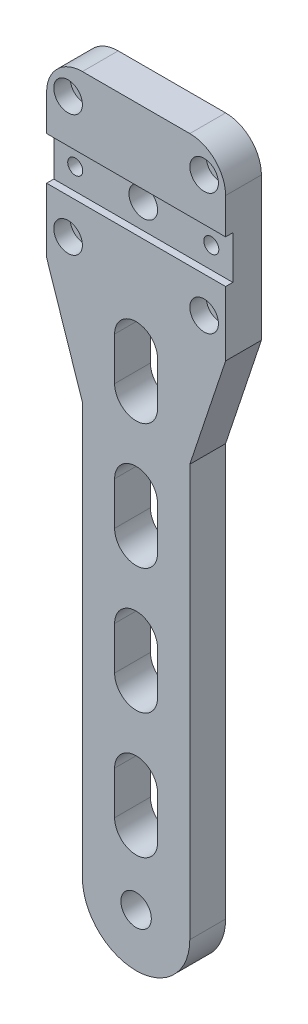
ISO-10303-21;
HEADER;
FILE_DESCRIPTION(('STEP AP214'),'2;1');
FILE_NAME('part.step','',(''),(''),'','','');
FILE_SCHEMA(('AUTOMOTIVE_DESIGN { 1 0 10303 214 1 1 1 1 }'));
ENDSEC;
DATA;
#1=APPLICATION_CONTEXT('core data for automotive mechanical design processes');
#2=APPLICATION_PROTOCOL_DEFINITION('international standard','automotive_design',2000,#1);
#3=PRODUCT_CONTEXT('',#1,'mechanical');
#4=PRODUCT('Part','Part','',(#3));
#5=PRODUCT_RELATED_PRODUCT_CATEGORY('part','',(#4));
#6=PRODUCT_DEFINITION_FORMATION('','',#4);
#7=PRODUCT_DEFINITION_CONTEXT('part definition',#1,'design');
#8=PRODUCT_DEFINITION('design','',#6,#7);
#9=PRODUCT_DEFINITION_SHAPE('','',#8);
#10=(LENGTH_UNIT() NAMED_UNIT(*) SI_UNIT(.MILLI.,.METRE.));
#11=(NAMED_UNIT(*) PLANE_ANGLE_UNIT() SI_UNIT($,.RADIAN.));
#12=(NAMED_UNIT(*) SI_UNIT($,.STERADIAN.) SOLID_ANGLE_UNIT());
#13=UNCERTAINTY_MEASURE_WITH_UNIT(LENGTH_MEASURE(1.E-05),#10,'distance_accuracy_value','');
#14=(GEOMETRIC_REPRESENTATION_CONTEXT(3) GLOBAL_UNCERTAINTY_ASSIGNED_CONTEXT((#13)) GLOBAL_UNIT_ASSIGNED_CONTEXT((#10,
#11,#12)) REPRESENTATION_CONTEXT('',''));
#15=CARTESIAN_POINT('',(0.,0.,0.));
#16=DIRECTION('',(0.,0.,1.));
#17=DIRECTION('',(1.,0.,0.));
#18=AXIS2_PLACEMENT_3D('',#15,#16,#17);
#19=CARTESIAN_POINT('',(0.,0.,10.));
#20=DIRECTION('',(0.,0.,1.));
#21=DIRECTION('',(1.,0.,0.));
#22=AXIS2_PLACEMENT_3D('',#19,#20,#21);
#23=PLANE('',#22);
#24=DIRECTION('',(-1.,0.,0.));
#25=VECTOR('',#24,1.);
#26=CARTESIAN_POINT('',(-333.652444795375,91.7263282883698,10.));
#27=LINE('',#26,#25);
#28=CARTESIAN_POINT('',(-333.652469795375,91.7263282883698,10.));
#29=VERTEX_POINT('',#28);
#30=CARTESIAN_POINT('',(-383.652469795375,91.7263282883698,10.));
#31=VERTEX_POINT('',#30);
#32=EDGE_CURVE('E249',#29,#31,#27,.T.);
#33=ORIENTED_EDGE('',*,*,#32,.T.);
#34=DIRECTION('',(0.,-1.,0.));
#35=VECTOR('',#34,1.);
#36=CARTESIAN_POINT('',(-383.652469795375,123.72632828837,10.));
#37=LINE('',#36,#35);
#38=CARTESIAN_POINT('',(-383.652469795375,73.7263282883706,10.));
#39=VERTEX_POINT('',#38);
#40=EDGE_CURVE('E390',#31,#39,#37,.T.);
#41=ORIENTED_EDGE('',*,*,#40,.T.);
#42=DIRECTION('',(-0.316227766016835,0.948683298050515,0.));
#43=VECTOR('',#42,1.);
#44=CARTESIAN_POINT('',(-323.169324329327,-107.723108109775,10.));
#45=LINE('',#44,#43);
#46=CARTESIAN_POINT('',(-373.652469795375,43.7263282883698,10.));
#47=VERTEX_POINT('',#46);
#48=EDGE_CURVE('E406',#39,#47,#45,.F.);
#49=ORIENTED_EDGE('',*,*,#48,.T.);
#50=DIRECTION('',(0.,-1.,0.));
#51=VECTOR('',#50,1.);
#52=CARTESIAN_POINT('',(-373.652469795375,-86.2736717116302,10.));
#53=LINE('',#52,#51);
#54=CARTESIAN_POINT('',(-373.652469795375,-71.2736717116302,10.));
#55=VERTEX_POINT('',#54);
#56=EDGE_CURVE('E400',#47,#55,#53,.T.);
#57=ORIENTED_EDGE('',*,*,#56,.T.);
#58=CARTESIAN_POINT('',(-358.652469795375,-71.2736717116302,10.));
#59=DIRECTION('',(0.,0.,1.));
#60=DIRECTION('',(1.,0.,0.));
#61=AXIS2_PLACEMENT_3D('',#58,#59,#60);
#62=CIRCLE('',#61,15.);
#63=CARTESIAN_POINT('',(-358.652469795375,-86.2736717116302,10.));
#64=VERTEX_POINT('',#63);
#65=EDGE_CURVE('E526',#55,#64,#62,.T.);
#66=ORIENTED_EDGE('',*,*,#65,.T.);
#67=CARTESIAN_POINT('',(-358.652469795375,-71.2736717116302,10.));
#68=DIRECTION('',(0.,0.,1.));
#69=DIRECTION('',(1.,0.,0.));
#70=AXIS2_PLACEMENT_3D('',#67,#68,#69);
#71=CIRCLE('',#70,15.);
#72=CARTESIAN_POINT('',(-343.652469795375,-71.2736717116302,10.));
#73=VERTEX_POINT('',#72);
#74=EDGE_CURVE('E535',#64,#73,#71,.T.);
#75=ORIENTED_EDGE('',*,*,#74,.T.);
#76=DIRECTION('',(0.,1.,0.));
#77=VECTOR('',#76,1.);
#78=CARTESIAN_POINT('',(-343.652469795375,-86.2736717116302,10.));
#79=LINE('',#78,#77);
#80=CARTESIAN_POINT('',(-343.652469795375,43.7263282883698,10.));
#81=VERTEX_POINT('',#80);
#82=EDGE_CURVE('E460',#73,#81,#79,.T.);
#83=ORIENTED_EDGE('',*,*,#82,.T.);
#84=DIRECTION('',(-0.316227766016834,-0.948683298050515,0.));
#85=VECTOR('',#84,1.);
#86=CARTESIAN_POINT('',(-322.405121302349,107.468373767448,10.));
#87=LINE('',#86,#85);
#88=CARTESIAN_POINT('',(-333.652469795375,73.7263282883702,10.));
#89=VERTEX_POINT('',#88);
#90=EDGE_CURVE('E413',#81,#89,#87,.F.);
#91=ORIENTED_EDGE('',*,*,#90,.T.);
#92=DIRECTION('',(0.,1.,0.));
#93=VECTOR('',#92,1.);
#94=CARTESIAN_POINT('',(-333.652469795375,123.72632828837,10.));
#95=LINE('',#94,#93);
#96=EDGE_CURVE('E490',#89,#29,#95,.T.);
#97=ORIENTED_EDGE('',*,*,#96,.T.);
#98=EDGE_LOOP('',(#33,#41,#49,#57,#66,#75,#83,#91,#97));
#99=FACE_BOUND('',#98,.T.);
#100=CARTESIAN_POINT('',(-377.652469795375,81.7263282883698,10.));
#101=DIRECTION('',(0.,0.,1.));
#102=DIRECTION('',(1.,0.,0.));
#103=AXIS2_PLACEMENT_3D('',#100,#101,#102);
#104=CIRCLE('',#103,4.);
#105=CARTESIAN_POINT('',(-373.652469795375,81.7263282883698,10.));
#106=VERTEX_POINT('',#105);
#107=EDGE_CURVE('E365',#106,#106,#104,.T.);
#108=ORIENTED_EDGE('',*,*,#107,.F.);
#109=EDGE_LOOP('',(#108));
#110=FACE_BOUND('',#109,.T.);
#111=CARTESIAN_POINT('',(-339.652469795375,81.7263282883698,10.));
#112=DIRECTION('',(0.,0.,1.));
#113=DIRECTION('',(1.,0.,0.));
#114=AXIS2_PLACEMENT_3D('',#111,#112,#113);
#115=CIRCLE('',#114,4.);
#116=CARTESIAN_POINT('',(-335.652469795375,81.7263282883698,10.));
#117=VERTEX_POINT('',#116);
#118=EDGE_CURVE('E355',#117,#117,#115,.T.);
#119=ORIENTED_EDGE('',*,*,#118,.F.);
#120=EDGE_LOOP('',(#119));
#121=FACE_BOUND('',#120,.T.);
#122=CARTESIAN_POINT('',(-358.652469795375,-71.5736717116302,10.));
#123=DIRECTION('',(0.,0.,1.));
#124=DIRECTION('',(1.,0.,0.));
#125=AXIS2_PLACEMENT_3D('',#122,#123,#124);
#126=CIRCLE('',#125,4.25);
#127=CARTESIAN_POINT('',(-354.402469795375,-71.5736717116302,10.));
#128=VERTEX_POINT('',#127);
#129=EDGE_CURVE('E341',#128,#128,#126,.T.);
#130=ORIENTED_EDGE('',*,*,#129,.F.);
#131=EDGE_LOOP('',(#130));
#132=FACE_BOUND('',#131,.T.);
#133=CARTESIAN_POINT('',(-358.652469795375,-52.2736717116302,10.));
#134=DIRECTION('',(0.,0.,1.));
#135=DIRECTION('',(1.,0.,0.));
#136=AXIS2_PLACEMENT_3D('',#133,#134,#135);
#137=CIRCLE('',#136,6.);
#138=CARTESIAN_POINT('',(-364.652469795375,-52.2736717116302,10.));
#139=VERTEX_POINT('',#138);
#140=CARTESIAN_POINT('',(-352.652469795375,-52.2736717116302,10.));
#141=VERTEX_POINT('',#140);
#142=EDGE_CURVE('E314',#139,#141,#137,.T.);
#143=ORIENTED_EDGE('',*,*,#142,.F.);
#144=DIRECTION('',(0.,-1.,0.));
#145=VECTOR('',#144,1.);
#146=CARTESIAN_POINT('',(-364.652469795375,-52.2736717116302,10.));
#147=LINE('',#146,#145);
#148=CARTESIAN_POINT('',(-364.652469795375,-40.2736717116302,10.));
#149=VERTEX_POINT('',#148);
#150=EDGE_CURVE('E328',#149,#139,#147,.T.);
#151=ORIENTED_EDGE('',*,*,#150,.F.);
#152=CARTESIAN_POINT('',(-358.652469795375,-40.2736717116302,10.));
#153=DIRECTION('',(0.,0.,1.));
#154=DIRECTION('',(1.,0.,0.));
#155=AXIS2_PLACEMENT_3D('',#152,#153,#154);
#156=CIRCLE('',#155,6.);
#157=CARTESIAN_POINT('',(-352.652469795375,-40.2736717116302,10.));
#158=VERTEX_POINT('',#157);
#159=EDGE_CURVE('E325',#158,#149,#156,.T.);
#160=ORIENTED_EDGE('',*,*,#159,.F.);
#161=DIRECTION('',(0.,1.,0.));
#162=VECTOR('',#161,1.);
#163=CARTESIAN_POINT('',(-352.652469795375,-52.2736717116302,10.));
#164=LINE('',#163,#162);
#165=EDGE_CURVE('E322',#141,#158,#164,.T.);
#166=ORIENTED_EDGE('',*,*,#165,.F.);
#167=EDGE_LOOP('',(#143,#151,#160,#166));
#168=FACE_BOUND('',#167,.T.);
#169=CARTESIAN_POINT('',(-358.652469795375,-17.2736717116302,10.));
#170=DIRECTION('',(0.,0.,1.));
#171=DIRECTION('',(1.,0.,0.));
#172=AXIS2_PLACEMENT_3D('',#169,#170,#171);
#173=CIRCLE('',#172,6.);
#174=CARTESIAN_POINT('',(-364.652469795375,-17.2736717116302,10.));
#175=VERTEX_POINT('',#174);
#176=CARTESIAN_POINT('',(-352.652469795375,-17.2736717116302,10.));
#177=VERTEX_POINT('',#176);
#178=EDGE_CURVE('E294',#175,#177,#173,.T.);
#179=ORIENTED_EDGE('',*,*,#178,.F.);
#180=DIRECTION('',(0.,-1.,0.));
#181=VECTOR('',#180,1.);
#182=CARTESIAN_POINT('',(-364.652469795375,-17.2736717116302,10.));
#183=LINE('',#182,#181);
#184=CARTESIAN_POINT('',(-364.652469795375,-5.27367171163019,10.));
#185=VERTEX_POINT('',#184);
#186=EDGE_CURVE('E308',#185,#175,#183,.T.);
#187=ORIENTED_EDGE('',*,*,#186,.F.);
#188=CARTESIAN_POINT('',(-358.652469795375,-5.27367171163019,10.));
#189=DIRECTION('',(0.,0.,1.));
#190=DIRECTION('',(1.,0.,0.));
#191=AXIS2_PLACEMENT_3D('',#188,#189,#190);
#192=CIRCLE('',#191,6.);
#193=CARTESIAN_POINT('',(-352.652469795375,-5.27367171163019,10.));
#194=VERTEX_POINT('',#193);
#195=EDGE_CURVE('E305',#194,#185,#192,.T.);
#196=ORIENTED_EDGE('',*,*,#195,.F.);
#197=DIRECTION('',(0.,1.,0.));
#198=VECTOR('',#197,1.);
#199=CARTESIAN_POINT('',(-352.652469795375,-17.2736717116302,10.));
#200=LINE('',#199,#198);
#201=EDGE_CURVE('E302',#177,#194,#200,.T.);
#202=ORIENTED_EDGE('',*,*,#201,.F.);
#203=EDGE_LOOP('',(#179,#187,#196,#202));
#204=FACE_BOUND('',#203,.T.);
#205=CARTESIAN_POINT('',(-358.652469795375,17.7263282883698,10.));
#206=DIRECTION('',(0.,0.,1.));
#207=DIRECTION('',(1.,0.,0.));
#208=AXIS2_PLACEMENT_3D('',#205,#206,#207);
#209=CIRCLE('',#208,6.);
#210=CARTESIAN_POINT('',(-364.652469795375,17.7263282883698,10.));
#211=VERTEX_POINT('',#210);
#212=CARTESIAN_POINT('',(-352.652469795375,17.7263282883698,10.));
#213=VERTEX_POINT('',#212);
#214=EDGE_CURVE('E275',#211,#213,#209,.T.);
#215=ORIENTED_EDGE('',*,*,#214,.F.);
#216=DIRECTION('',(0.,-1.,0.));
#217=VECTOR('',#216,1.);
#218=CARTESIAN_POINT('',(-364.652469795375,17.7263282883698,10.));
#219=LINE('',#218,#217);
#220=CARTESIAN_POINT('',(-364.652469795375,29.7263282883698,10.));
#221=VERTEX_POINT('',#220);
#222=EDGE_CURVE('E288',#221,#211,#219,.T.);
#223=ORIENTED_EDGE('',*,*,#222,.F.);
#224=CARTESIAN_POINT('',(-358.652469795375,29.7263282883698,10.));
#225=DIRECTION('',(0.,0.,1.));
#226=DIRECTION('',(1.,0.,0.));
#227=AXIS2_PLACEMENT_3D('',#224,#225,#226);
#228=CIRCLE('',#227,6.);
#229=CARTESIAN_POINT('',(-352.652469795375,29.7263282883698,10.));
#230=VERTEX_POINT('',#229);
#231=EDGE_CURVE('E285',#230,#221,#228,.T.);
#232=ORIENTED_EDGE('',*,*,#231,.F.);
#233=DIRECTION('',(0.,1.,0.));
#234=VECTOR('',#233,1.);
#235=CARTESIAN_POINT('',(-352.652469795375,17.7263282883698,10.));
#236=LINE('',#235,#234);
#237=EDGE_CURVE('E282',#213,#230,#236,.T.);
#238=ORIENTED_EDGE('',*,*,#237,.F.);
#239=EDGE_LOOP('',(#215,#223,#232,#238));
#240=FACE_BOUND('',#239,.T.);
#241=CARTESIAN_POINT('',(-358.652469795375,52.7263282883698,10.));
#242=DIRECTION('',(0.,0.,1.));
#243=DIRECTION('',(1.,0.,0.));
#244=AXIS2_PLACEMENT_3D('',#241,#242,#243);
#245=CIRCLE('',#244,6.);
#246=CARTESIAN_POINT('',(-364.652469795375,52.7263282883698,10.));
#247=VERTEX_POINT('',#246);
#248=CARTESIAN_POINT('',(-352.652469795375,52.7263282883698,10.));
#249=VERTEX_POINT('',#248);
#250=EDGE_CURVE('E41',#247,#249,#245,.T.);
#251=ORIENTED_EDGE('',*,*,#250,.F.);
#252=DIRECTION('',(0.,-1.,0.));
#253=VECTOR('',#252,1.);
#254=CARTESIAN_POINT('',(-364.652469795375,52.7263282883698,10.));
#255=LINE('',#254,#253);
#256=CARTESIAN_POINT('',(-364.652469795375,64.7263282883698,10.));
#257=VERTEX_POINT('',#256);
#258=EDGE_CURVE('E269',#257,#247,#255,.T.);
#259=ORIENTED_EDGE('',*,*,#258,.F.);
#260=CARTESIAN_POINT('',(-358.652469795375,64.7263282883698,10.));
#261=DIRECTION('',(0.,0.,1.));
#262=DIRECTION('',(1.,0.,0.));
#263=AXIS2_PLACEMENT_3D('',#260,#261,#262);
#264=CIRCLE('',#263,6.);
#265=CARTESIAN_POINT('',(-352.652469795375,64.7263282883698,10.));
#266=VERTEX_POINT('',#265);
#267=EDGE_CURVE('E266',#266,#257,#264,.T.);
#268=ORIENTED_EDGE('',*,*,#267,.F.);
#269=DIRECTION('',(0.,1.,0.));
#270=VECTOR('',#269,1.);
#271=CARTESIAN_POINT('',(-352.652469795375,52.7263282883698,10.));
#272=LINE('',#271,#270);
#273=EDGE_CURVE('E263',#249,#266,#272,.T.);
#274=ORIENTED_EDGE('',*,*,#273,.F.);
#275=EDGE_LOOP('',(#251,#259,#268,#274));
#276=FACE_BOUND('',#275,.T.);
#277=ADVANCED_FACE('F16',(#99,#110,#121,#132,#168,#204,#240,#276),#23,.T.);
#278=CARTESIAN_POINT('',(-373.652469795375,-86.2736717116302,10.));
#279=DIRECTION('',(1.,0.,0.));
#280=DIRECTION('',(0.,0.,-1.));
#281=AXIS2_PLACEMENT_3D('',#278,#279,#280);
#282=PLANE('',#281);
#283=DIRECTION('',(0.,-1.,0.));
#284=VECTOR('',#283,1.);
#285=CARTESIAN_POINT('',(-373.652469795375,-86.2736717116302,0.));
#286=LINE('',#285,#284);
#287=CARTESIAN_POINT('',(-373.652469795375,43.7263282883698,0.));
#288=VERTEX_POINT('',#287);
#289=CARTESIAN_POINT('',(-373.652469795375,-71.2736717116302,0.));
#290=VERTEX_POINT('',#289);
#291=EDGE_CURVE('E469',#288,#290,#286,.T.);
#292=ORIENTED_EDGE('',*,*,#291,.T.);
#293=DIRECTION('',(0.,0.,-1.));
#294=VECTOR('',#293,1.);
#295=CARTESIAN_POINT('',(-373.652469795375,-71.2736717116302,10.));
#296=LINE('',#295,#294);
#297=EDGE_CURVE('E532',#290,#55,#296,.F.);
#298=ORIENTED_EDGE('',*,*,#297,.T.);
#299=ORIENTED_EDGE('',*,*,#56,.F.);
#300=DIRECTION('',(0.,0.,1.));
#301=VECTOR('',#300,1.);
#302=CARTESIAN_POINT('',(-373.652469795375,43.7263282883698,0.));
#303=LINE('',#302,#301);
#304=EDGE_CURVE('E387',#288,#47,#303,.T.);
#305=ORIENTED_EDGE('',*,*,#304,.F.);
#306=EDGE_LOOP('',(#292,#298,#299,#305));
#307=FACE_BOUND('',#306,.T.);
#308=ADVANCED_FACE('F610',(#307),#282,.F.);
#309=CARTESIAN_POINT('',(-343.652469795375,-86.2736717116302,10.));
#310=DIRECTION('',(-1.,0.,0.));
#311=DIRECTION('',(0.,0.,1.));
#312=AXIS2_PLACEMENT_3D('',#309,#310,#311);
#313=PLANE('',#312);
#314=ORIENTED_EDGE('',*,*,#82,.F.);
#315=DIRECTION('',(0.,0.,-1.));
#316=VECTOR('',#315,1.);
#317=CARTESIAN_POINT('',(-343.652469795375,-71.2736717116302,10.));
#318=LINE('',#317,#316);
#319=CARTESIAN_POINT('',(-343.652469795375,-71.2736717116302,0.));
#320=VERTEX_POINT('',#319);
#321=EDGE_CURVE('E444',#73,#320,#318,.T.);
#322=ORIENTED_EDGE('',*,*,#321,.T.);
#323=DIRECTION('',(0.,1.,0.));
#324=VECTOR('',#323,1.);
#325=CARTESIAN_POINT('',(-343.652469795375,-86.2736717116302,0.));
#326=LINE('',#325,#324);
#327=CARTESIAN_POINT('',(-343.652469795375,43.7263282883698,0.));
#328=VERTEX_POINT('',#327);
#329=EDGE_CURVE('E455',#320,#328,#326,.T.);
#330=ORIENTED_EDGE('',*,*,#329,.T.);
#331=DIRECTION('',(0.,0.,1.));
#332=VECTOR('',#331,1.);
#333=CARTESIAN_POINT('',(-343.652469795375,43.7263282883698,0.));
#334=LINE('',#333,#332);
#335=EDGE_CURVE('E472',#328,#81,#334,.T.);
#336=ORIENTED_EDGE('',*,*,#335,.T.);
#337=EDGE_LOOP('',(#314,#322,#330,#336));
#338=FACE_BOUND('',#337,.T.);
#339=ADVANCED_FACE('F518',(#338),#313,.F.);
#340=CARTESIAN_POINT('',(-343.652469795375,123.72632828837,10.));
#341=DIRECTION('',(0.,-1.,0.));
#342=DIRECTION('',(0.,0.,-1.));
#343=AXIS2_PLACEMENT_3D('',#340,#341,#342);
#344=PLANE('',#343);
#345=DIRECTION('',(-1.,0.,0.));
#346=VECTOR('',#345,1.);
#347=CARTESIAN_POINT('',(-343.652469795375,123.72632828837,0.));
#348=LINE('',#347,#346);
#349=CARTESIAN_POINT('',(-343.652469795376,123.72632828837,0.));
#350=VERTEX_POINT('',#349);
#351=CARTESIAN_POINT('',(-373.652469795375,123.72632828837,0.));
#352=VERTEX_POINT('',#351);
#353=EDGE_CURVE('E458',#350,#352,#348,.T.);
#354=ORIENTED_EDGE('',*,*,#353,.T.);
#355=DIRECTION('',(0.,0.,1.));
#356=VECTOR('',#355,1.);
#357=CARTESIAN_POINT('',(-373.652469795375,123.72632828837,10.));
#358=LINE('',#357,#356);
#359=CARTESIAN_POINT('',(-373.652469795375,123.72632828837,10.));
#360=VERTEX_POINT('',#359);
#361=EDGE_CURVE('E428',#352,#360,#358,.T.);
#362=ORIENTED_EDGE('',*,*,#361,.T.);
#363=DIRECTION('',(-1.,0.,0.));
#364=VECTOR('',#363,1.);
#365=CARTESIAN_POINT('',(-343.652469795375,123.72632828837,10.));
#366=LINE('',#365,#364);
#367=CARTESIAN_POINT('',(-343.652469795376,123.72632828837,10.));
#368=VERTEX_POINT('',#367);
#369=EDGE_CURVE('E478',#368,#360,#366,.T.);
#370=ORIENTED_EDGE('',*,*,#369,.F.);
#371=DIRECTION('',(0.,0.,1.));
#372=VECTOR('',#371,1.);
#373=CARTESIAN_POINT('',(-343.652469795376,123.72632828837,0.));
#374=LINE('',#373,#372);
#375=EDGE_CURVE('E424',#368,#350,#374,.F.);
#376=ORIENTED_EDGE('',*,*,#375,.T.);
#377=EDGE_LOOP('',(#354,#362,#370,#376));
#378=FACE_BOUND('',#377,.T.);
#379=ADVANCED_FACE('F621',(#378),#344,.F.);
#380=DIRECTION('',(-1.,0.,0.));
#381=VECTOR('',#380,1.);
#382=CARTESIAN_POINT('',(-333.652444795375,103.72632828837,10.));
#383=LINE('',#382,#381);
#384=CARTESIAN_POINT('',(-333.652469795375,103.72632828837,10.));
#385=VERTEX_POINT('',#384);
#386=CARTESIAN_POINT('',(-383.652469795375,103.72632828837,10.));
#387=VERTEX_POINT('',#386);
#388=EDGE_CURVE('E33',#385,#387,#383,.T.);
#389=ORIENTED_EDGE('',*,*,#388,.F.);
#390=CARTESIAN_POINT('',(-333.652469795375,113.72632828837,10.));
#391=VERTEX_POINT('',#390);
#392=EDGE_CURVE('E399',#385,#391,#95,.T.);
#393=ORIENTED_EDGE('',*,*,#392,.T.);
#394=CARTESIAN_POINT('',(-343.652469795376,113.72632828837,10.));
#395=DIRECTION('',(0.,0.,1.));
#396=DIRECTION('',(1.,0.,0.));
#397=AXIS2_PLACEMENT_3D('',#394,#395,#396);
#398=CIRCLE('',#397,10.);
#399=EDGE_CURVE('E431',#391,#368,#398,.T.);
#400=ORIENTED_EDGE('',*,*,#399,.T.);
#401=ORIENTED_EDGE('',*,*,#369,.T.);
#402=CARTESIAN_POINT('',(-373.652469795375,113.72632828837,10.));
#403=DIRECTION('',(0.,0.,1.));
#404=DIRECTION('',(1.,0.,0.));
#405=AXIS2_PLACEMENT_3D('',#402,#403,#404);
#406=CIRCLE('',#405,10.);
#407=CARTESIAN_POINT('',(-383.652469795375,113.72632828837,10.));
#408=VERTEX_POINT('',#407);
#409=EDGE_CURVE('E433',#360,#408,#406,.T.);
#410=ORIENTED_EDGE('',*,*,#409,.T.);
#411=EDGE_CURVE('E388',#408,#387,#37,.T.);
#412=ORIENTED_EDGE('',*,*,#411,.T.);
#413=EDGE_LOOP('',(#389,#393,#400,#401,#410,#412));
#414=FACE_BOUND('',#413,.T.);
#415=CARTESIAN_POINT('',(-339.652469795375,115.72632828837,10.));
#416=DIRECTION('',(0.,0.,1.));
#417=DIRECTION('',(1.,0.,0.));
#418=AXIS2_PLACEMENT_3D('',#415,#416,#417);
#419=CIRCLE('',#418,4.);
#420=CARTESIAN_POINT('',(-335.652469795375,115.72632828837,10.));
#421=VERTEX_POINT('',#420);
#422=EDGE_CURVE('E345',#421,#421,#419,.T.);
#423=ORIENTED_EDGE('',*,*,#422,.F.);
#424=EDGE_LOOP('',(#423));
#425=FACE_BOUND('',#424,.T.);
#426=CARTESIAN_POINT('',(-377.652469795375,115.72632828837,10.));
#427=DIRECTION('',(0.,0.,1.));
#428=DIRECTION('',(1.,0.,0.));
#429=AXIS2_PLACEMENT_3D('',#426,#427,#428);
#430=CIRCLE('',#429,4.);
#431=CARTESIAN_POINT('',(-373.652469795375,115.72632828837,10.));
#432=VERTEX_POINT('',#431);
#433=EDGE_CURVE('E375',#432,#432,#430,.T.);
#434=ORIENTED_EDGE('',*,*,#433,.F.);
#435=EDGE_LOOP('',(#434));
#436=FACE_BOUND('',#435,.T.);
#437=ADVANCED_FACE('F496',(#414,#425,#436),#23,.T.);
#438=CARTESIAN_POINT('',(0.,0.,0.));
#439=DIRECTION('',(0.,0.,1.));
#440=DIRECTION('',(1.,0.,0.));
#441=AXIS2_PLACEMENT_3D('',#438,#439,#440);
#442=PLANE('',#441);
#443=CARTESIAN_POINT('',(-339.652469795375,97.7263282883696,0.));
#444=DIRECTION('',(0.,0.,1.));
#445=DIRECTION('',(1.,0.,0.));
#446=AXIS2_PLACEMENT_3D('',#443,#444,#445);
#447=CIRCLE('',#446,2.1);
#448=CARTESIAN_POINT('',(-337.552469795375,97.7263282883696,0.));
#449=VERTEX_POINT('',#448);
#450=EDGE_CURVE('E20',#449,#449,#447,.T.);
#451=ORIENTED_EDGE('',*,*,#450,.T.);
#452=EDGE_LOOP('',(#451));
#453=FACE_BOUND('',#452,.T.);
#454=CARTESIAN_POINT('',(-377.652469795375,97.7263282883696,0.));
#455=DIRECTION('',(0.,0.,1.));
#456=DIRECTION('',(1.,0.,0.));
#457=AXIS2_PLACEMENT_3D('',#454,#455,#456);
#458=CIRCLE('',#457,2.1);
#459=CARTESIAN_POINT('',(-375.552469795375,97.7263282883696,0.));
#460=VERTEX_POINT('',#459);
#461=EDGE_CURVE('E583',#460,#460,#458,.T.);
#462=ORIENTED_EDGE('',*,*,#461,.T.);
#463=EDGE_LOOP('',(#462));
#464=FACE_BOUND('',#463,.T.);
#465=DIRECTION('',(0.,-1.,0.));
#466=VECTOR('',#465,1.);
#467=CARTESIAN_POINT('',(-364.652469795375,0.,0.));
#468=LINE('',#467,#466);
#469=CARTESIAN_POINT('',(-364.652469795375,64.7263282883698,0.));
#470=VERTEX_POINT('',#469);
#471=CARTESIAN_POINT('',(-364.652469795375,52.7263282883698,0.));
#472=VERTEX_POINT('',#471);
#473=EDGE_CURVE('E25',#470,#472,#468,.T.);
#474=ORIENTED_EDGE('',*,*,#473,.T.);
#475=CARTESIAN_POINT('',(-358.652469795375,52.7263282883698,0.));
#476=DIRECTION('',(0.,0.,1.));
#477=DIRECTION('',(1.,0.,0.));
#478=AXIS2_PLACEMENT_3D('',#475,#476,#477);
#479=CIRCLE('',#478,6.);
#480=CARTESIAN_POINT('',(-352.652469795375,52.7263282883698,0.));
#481=VERTEX_POINT('',#480);
#482=EDGE_CURVE('E11',#472,#481,#479,.T.);
#483=ORIENTED_EDGE('',*,*,#482,.T.);
#484=DIRECTION('',(0.,1.,0.));
#485=VECTOR('',#484,1.);
#486=CARTESIAN_POINT('',(-352.652469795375,0.,0.));
#487=LINE('',#486,#485);
#488=CARTESIAN_POINT('',(-352.652469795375,64.7263282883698,0.));
#489=VERTEX_POINT('',#488);
#490=EDGE_CURVE('E576',#481,#489,#487,.T.);
#491=ORIENTED_EDGE('',*,*,#490,.T.);
#492=CARTESIAN_POINT('',(-358.652469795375,64.7263282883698,0.));
#493=DIRECTION('',(0.,0.,1.));
#494=DIRECTION('',(1.,0.,0.));
#495=AXIS2_PLACEMENT_3D('',#492,#493,#494);
#496=CIRCLE('',#495,6.);
#497=EDGE_CURVE('E579',#489,#470,#496,.T.);
#498=ORIENTED_EDGE('',*,*,#497,.T.);
#499=EDGE_LOOP('',(#474,#483,#491,#498));
#500=FACE_BOUND('',#499,.T.);
#501=DIRECTION('',(0.,-1.,0.));
#502=VECTOR('',#501,1.);
#503=CARTESIAN_POINT('',(-364.652469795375,0.,0.));
#504=LINE('',#503,#502);
#505=CARTESIAN_POINT('',(-364.652469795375,29.7263282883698,0.));
#506=VERTEX_POINT('',#505);
#507=CARTESIAN_POINT('',(-364.652469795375,17.7263282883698,0.));
#508=VERTEX_POINT('',#507);
#509=EDGE_CURVE('E570',#506,#508,#504,.T.);
#510=ORIENTED_EDGE('',*,*,#509,.T.);
#511=CARTESIAN_POINT('',(-358.652469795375,17.7263282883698,0.));
#512=DIRECTION('',(0.,0.,1.));
#513=DIRECTION('',(1.,0.,0.));
#514=AXIS2_PLACEMENT_3D('',#511,#512,#513);
#515=CIRCLE('',#514,6.);
#516=CARTESIAN_POINT('',(-352.652469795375,17.7263282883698,0.));
#517=VERTEX_POINT('',#516);
#518=EDGE_CURVE('E573',#508,#517,#515,.T.);
#519=ORIENTED_EDGE('',*,*,#518,.T.);
#520=DIRECTION('',(0.,1.,0.));
#521=VECTOR('',#520,1.);
#522=CARTESIAN_POINT('',(-352.652469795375,0.,0.));
#523=LINE('',#522,#521);
#524=CARTESIAN_POINT('',(-352.652469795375,29.7263282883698,0.));
#525=VERTEX_POINT('',#524);
#526=EDGE_CURVE('E564',#517,#525,#523,.T.);
#527=ORIENTED_EDGE('',*,*,#526,.T.);
#528=CARTESIAN_POINT('',(-358.652469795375,29.7263282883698,0.));
#529=DIRECTION('',(0.,0.,1.));
#530=DIRECTION('',(1.,0.,0.));
#531=AXIS2_PLACEMENT_3D('',#528,#529,#530);
#532=CIRCLE('',#531,6.);
#533=EDGE_CURVE('E567',#525,#506,#532,.T.);
#534=ORIENTED_EDGE('',*,*,#533,.T.);
#535=EDGE_LOOP('',(#510,#519,#527,#534));
#536=FACE_BOUND('',#535,.T.);
#537=DIRECTION('',(0.,-1.,0.));
#538=VECTOR('',#537,1.);
#539=CARTESIAN_POINT('',(-364.652469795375,0.,0.));
#540=LINE('',#539,#538);
#541=CARTESIAN_POINT('',(-364.652469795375,-5.27367171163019,0.));
#542=VERTEX_POINT('',#541);
#543=CARTESIAN_POINT('',(-364.652469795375,-17.2736717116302,0.));
#544=VERTEX_POINT('',#543);
#545=EDGE_CURVE('E558',#542,#544,#540,.T.);
#546=ORIENTED_EDGE('',*,*,#545,.T.);
#547=CARTESIAN_POINT('',(-358.652469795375,-17.2736717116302,0.));
#548=DIRECTION('',(0.,0.,1.));
#549=DIRECTION('',(1.,0.,0.));
#550=AXIS2_PLACEMENT_3D('',#547,#548,#549);
#551=CIRCLE('',#550,6.);
#552=CARTESIAN_POINT('',(-352.652469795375,-17.2736717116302,0.));
#553=VERTEX_POINT('',#552);
#554=EDGE_CURVE('E561',#544,#553,#551,.T.);
#555=ORIENTED_EDGE('',*,*,#554,.T.);
#556=DIRECTION('',(0.,1.,0.));
#557=VECTOR('',#556,1.);
#558=CARTESIAN_POINT('',(-352.652469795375,0.,0.));
#559=LINE('',#558,#557);
#560=CARTESIAN_POINT('',(-352.652469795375,-5.27367171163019,0.));
#561=VERTEX_POINT('',#560);
#562=EDGE_CURVE('E552',#553,#561,#559,.T.);
#563=ORIENTED_EDGE('',*,*,#562,.T.);
#564=CARTESIAN_POINT('',(-358.652469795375,-5.27367171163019,0.));
#565=DIRECTION('',(0.,0.,1.));
#566=DIRECTION('',(1.,0.,0.));
#567=AXIS2_PLACEMENT_3D('',#564,#565,#566);
#568=CIRCLE('',#567,6.);
#569=EDGE_CURVE('E555',#561,#542,#568,.T.);
#570=ORIENTED_EDGE('',*,*,#569,.T.);
#571=EDGE_LOOP('',(#546,#555,#563,#570));
#572=FACE_BOUND('',#571,.T.);
#573=DIRECTION('',(0.,-1.,0.));
#574=VECTOR('',#573,1.);
#575=CARTESIAN_POINT('',(-364.652469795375,0.,0.));
#576=LINE('',#575,#574);
#577=CARTESIAN_POINT('',(-364.652469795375,-40.2736717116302,0.));
#578=VERTEX_POINT('',#577);
#579=CARTESIAN_POINT('',(-364.652469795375,-52.2736717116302,0.));
#580=VERTEX_POINT('',#579);
#581=EDGE_CURVE('E546',#578,#580,#576,.T.);
#582=ORIENTED_EDGE('',*,*,#581,.T.);
#583=CARTESIAN_POINT('',(-358.652469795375,-52.2736717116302,0.));
#584=DIRECTION('',(0.,0.,1.));
#585=DIRECTION('',(1.,0.,0.));
#586=AXIS2_PLACEMENT_3D('',#583,#584,#585);
#587=CIRCLE('',#586,6.);
#588=CARTESIAN_POINT('',(-352.652469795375,-52.2736717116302,0.));
#589=VERTEX_POINT('',#588);
#590=EDGE_CURVE('E549',#580,#589,#587,.T.);
#591=ORIENTED_EDGE('',*,*,#590,.T.);
#592=DIRECTION('',(0.,1.,0.));
#593=VECTOR('',#592,1.);
#594=CARTESIAN_POINT('',(-352.652469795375,0.,0.));
#595=LINE('',#594,#593);
#596=CARTESIAN_POINT('',(-352.652469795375,-40.2736717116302,0.));
#597=VERTEX_POINT('',#596);
#598=EDGE_CURVE('E540',#589,#597,#595,.T.);
#599=ORIENTED_EDGE('',*,*,#598,.T.);
#600=CARTESIAN_POINT('',(-358.652469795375,-40.2736717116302,0.));
#601=DIRECTION('',(0.,0.,1.));
#602=DIRECTION('',(1.,0.,0.));
#603=AXIS2_PLACEMENT_3D('',#600,#601,#602);
#604=CIRCLE('',#603,6.);
#605=EDGE_CURVE('E543',#597,#578,#604,.T.);
#606=ORIENTED_EDGE('',*,*,#605,.T.);
#607=EDGE_LOOP('',(#582,#591,#599,#606));
#608=FACE_BOUND('',#607,.T.);
#609=CARTESIAN_POINT('',(-358.652469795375,-71.5736717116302,0.));
#610=DIRECTION('',(0.,0.,1.));
#611=DIRECTION('',(1.,0.,0.));
#612=AXIS2_PLACEMENT_3D('',#609,#610,#611);
#613=CIRCLE('',#612,4.25);
#614=CARTESIAN_POINT('',(-354.402469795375,-71.5736717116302,0.));
#615=VERTEX_POINT('',#614);
#616=EDGE_CURVE('E344',#615,#615,#613,.T.);
#617=ORIENTED_EDGE('',*,*,#616,.T.);
#618=EDGE_LOOP('',(#617));
#619=FACE_BOUND('',#618,.T.);
#620=CARTESIAN_POINT('',(-339.652469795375,115.72632828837,0.));
#621=DIRECTION('',(0.,0.,1.));
#622=DIRECTION('',(1.,0.,0.));
#623=AXIS2_PLACEMENT_3D('',#620,#621,#622);
#624=CIRCLE('',#623,2.24999999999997);
#625=CARTESIAN_POINT('',(-337.402469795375,115.72632828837,0.));
#626=VERTEX_POINT('',#625);
#627=EDGE_CURVE('E354',#626,#626,#624,.T.);
#628=ORIENTED_EDGE('',*,*,#627,.T.);
#629=EDGE_LOOP('',(#628));
#630=FACE_BOUND('',#629,.T.);
#631=CARTESIAN_POINT('',(-339.652469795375,81.7263282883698,0.));
#632=DIRECTION('',(0.,0.,1.));
#633=DIRECTION('',(1.,0.,0.));
#634=AXIS2_PLACEMENT_3D('',#631,#632,#633);
#635=CIRCLE('',#634,2.24999999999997);
#636=CARTESIAN_POINT('',(-337.402469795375,81.7263282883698,0.));
#637=VERTEX_POINT('',#636);
#638=EDGE_CURVE('E364',#637,#637,#635,.T.);
#639=ORIENTED_EDGE('',*,*,#638,.T.);
#640=EDGE_LOOP('',(#639));
#641=FACE_BOUND('',#640,.T.);
#642=CARTESIAN_POINT('',(-377.652469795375,81.7263282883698,0.));
#643=DIRECTION('',(0.,0.,1.));
#644=DIRECTION('',(1.,0.,0.));
#645=AXIS2_PLACEMENT_3D('',#642,#643,#644);
#646=CIRCLE('',#645,2.24999999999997);
#647=CARTESIAN_POINT('',(-375.402469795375,81.7263282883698,0.));
#648=VERTEX_POINT('',#647);
#649=EDGE_CURVE('E374',#648,#648,#646,.T.);
#650=ORIENTED_EDGE('',*,*,#649,.T.);
#651=EDGE_LOOP('',(#650));
#652=FACE_BOUND('',#651,.T.);
#653=CARTESIAN_POINT('',(-377.652469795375,115.72632828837,0.));
#654=DIRECTION('',(0.,0.,1.));
#655=DIRECTION('',(1.,0.,0.));
#656=AXIS2_PLACEMENT_3D('',#653,#654,#655);
#657=CIRCLE('',#656,2.24999999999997);
#658=CARTESIAN_POINT('',(-375.402469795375,115.72632828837,0.));
#659=VERTEX_POINT('',#658);
#660=EDGE_CURVE('E384',#659,#659,#657,.T.);
#661=ORIENTED_EDGE('',*,*,#660,.T.);
#662=EDGE_LOOP('',(#661));
#663=FACE_BOUND('',#662,.T.);
#664=CARTESIAN_POINT('',(-358.652469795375,98.7263282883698,0.));
#665=DIRECTION('',(0.,0.,1.));
#666=DIRECTION('',(1.,0.,0.));
#667=AXIS2_PLACEMENT_3D('',#664,#665,#666);
#668=CIRCLE('',#667,4.);
#669=CARTESIAN_POINT('',(-354.652469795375,98.7263282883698,0.));
#670=VERTEX_POINT('',#669);
#671=EDGE_CURVE('E459',#670,#670,#668,.T.);
#672=ORIENTED_EDGE('',*,*,#671,.T.);
#673=EDGE_LOOP('',(#672));
#674=FACE_BOUND('',#673,.T.);
#675=ORIENTED_EDGE('',*,*,#329,.F.);
#676=CARTESIAN_POINT('',(-358.652469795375,-71.2736717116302,0.));
#677=DIRECTION('',(0.,0.,1.));
#678=DIRECTION('',(1.,0.,0.));
#679=AXIS2_PLACEMENT_3D('',#676,#677,#678);
#680=CIRCLE('',#679,15.);
#681=CARTESIAN_POINT('',(-358.652469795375,-86.2736717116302,0.));
#682=VERTEX_POINT('',#681);
#683=EDGE_CURVE('E521',#320,#682,#680,.F.);
#684=ORIENTED_EDGE('',*,*,#683,.T.);
#685=CARTESIAN_POINT('',(-358.652469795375,-71.2736717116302,0.));
#686=DIRECTION('',(0.,0.,1.));
#687=DIRECTION('',(1.,0.,0.));
#688=AXIS2_PLACEMENT_3D('',#685,#686,#687);
#689=CIRCLE('',#688,15.);
#690=EDGE_CURVE('E523',#682,#290,#689,.F.);
#691=ORIENTED_EDGE('',*,*,#690,.T.);
#692=ORIENTED_EDGE('',*,*,#291,.F.);
#693=DIRECTION('',(0.316227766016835,-0.948683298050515,0.));
#694=VECTOR('',#693,1.);
#695=CARTESIAN_POINT('',(-383.652469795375,73.7263282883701,0.));
#696=LINE('',#695,#694);
#697=CARTESIAN_POINT('',(-383.652469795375,73.7263282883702,0.));
#698=VERTEX_POINT('',#697);
#699=EDGE_CURVE('E408',#288,#698,#696,.F.);
#700=ORIENTED_EDGE('',*,*,#699,.T.);
#701=DIRECTION('',(0.,-1.,0.));
#702=VECTOR('',#701,1.);
#703=CARTESIAN_POINT('',(-383.652469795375,123.72632828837,0.));
#704=LINE('',#703,#702);
#705=CARTESIAN_POINT('',(-383.652469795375,113.72632828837,0.));
#706=VERTEX_POINT('',#705);
#707=EDGE_CURVE('E385',#706,#698,#704,.T.);
#708=ORIENTED_EDGE('',*,*,#707,.F.);
#709=CARTESIAN_POINT('',(-373.652469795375,113.72632828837,0.));
#710=DIRECTION('',(0.,0.,1.));
#711=DIRECTION('',(1.,0.,0.));
#712=AXIS2_PLACEMENT_3D('',#709,#710,#711);
#713=CIRCLE('',#712,10.);
#714=EDGE_CURVE('E439',#706,#352,#713,.F.);
#715=ORIENTED_EDGE('',*,*,#714,.T.);
#716=ORIENTED_EDGE('',*,*,#353,.F.);
#717=CARTESIAN_POINT('',(-343.652469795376,113.72632828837,0.));
#718=DIRECTION('',(0.,0.,1.));
#719=DIRECTION('',(1.,0.,0.));
#720=AXIS2_PLACEMENT_3D('',#717,#718,#719);
#721=CIRCLE('',#720,10.);
#722=CARTESIAN_POINT('',(-333.652469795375,113.72632828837,0.));
#723=VERTEX_POINT('',#722);
#724=EDGE_CURVE('E437',#350,#723,#721,.F.);
#725=ORIENTED_EDGE('',*,*,#724,.T.);
#726=DIRECTION('',(0.,1.,0.));
#727=VECTOR('',#726,1.);
#728=CARTESIAN_POINT('',(-333.652469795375,123.72632828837,0.));
#729=LINE('',#728,#727);
#730=CARTESIAN_POINT('',(-333.652469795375,73.7263282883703,0.));
#731=VERTEX_POINT('',#730);
#732=EDGE_CURVE('E393',#731,#723,#729,.T.);
#733=ORIENTED_EDGE('',*,*,#732,.F.);
#734=DIRECTION('',(0.316227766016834,0.948683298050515,0.));
#735=VECTOR('',#734,1.);
#736=CARTESIAN_POINT('',(-343.652469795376,43.7263282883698,0.));
#737=LINE('',#736,#735);
#738=EDGE_CURVE('E421',#731,#328,#737,.F.);
#739=ORIENTED_EDGE('',*,*,#738,.T.);
#740=EDGE_LOOP('',(#675,#684,#691,#692,#700,#708,#715,#716,#725,#733,#739));
#741=FACE_BOUND('',#740,.T.);
#742=ADVANCED_FACE('F511',(#453,#464,#500,#536,#572,#608,#619,#630,#641,#652,#663,#674,#741),
#442,.F.);
#743=CARTESIAN_POINT('',(-358.652469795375,98.7263282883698,0.));
#744=DIRECTION('',(0.,0.,1.));
#745=DIRECTION('',(1.,0.,0.));
#746=AXIS2_PLACEMENT_3D('',#743,#744,#745);
#747=CYLINDRICAL_SURFACE('',#746,4.);
#748=CARTESIAN_POINT('',(-358.652469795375,98.7263282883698,8.));
#749=DIRECTION('',(0.,0.,-1.));
#750=DIRECTION('',(-1.,0.,0.));
#751=AXIS2_PLACEMENT_3D('',#748,#749,#750);
#752=CIRCLE('',#751,4.);
#753=CARTESIAN_POINT('',(-362.652469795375,98.7263282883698,8.));
#754=VERTEX_POINT('',#753);
#755=EDGE_CURVE('E257',#754,#754,#752,.F.);
#756=ORIENTED_EDGE('',*,*,#755,.T.);
#757=EDGE_LOOP('',(#756));
#758=FACE_BOUND('',#757,.T.);
#759=ORIENTED_EDGE('',*,*,#671,.F.);
#760=EDGE_LOOP('',(#759));
#761=FACE_BOUND('',#760,.T.);
#762=ADVANCED_FACE('F627',(#758,#761),#747,.F.);
#763=CARTESIAN_POINT('',(-333.652469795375,123.72632828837,0.));
#764=DIRECTION('',(1.,0.,0.));
#765=DIRECTION('',(0.,0.,-1.));
#766=AXIS2_PLACEMENT_3D('',#763,#764,#765);
#767=PLANE('',#766);
#768=DIRECTION('',(0.,0.,-1.));
#769=VECTOR('',#768,1.);
#770=CARTESIAN_POINT('',(-333.652469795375,91.7263282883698,0.));
#771=LINE('',#770,#769);
#772=CARTESIAN_POINT('',(-333.652469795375,91.7263282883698,8.));
#773=VERTEX_POINT('',#772);
#774=EDGE_CURVE('E260',#29,#773,#771,.T.);
#775=ORIENTED_EDGE('',*,*,#774,.F.);
#776=ORIENTED_EDGE('',*,*,#96,.F.);
#777=DIRECTION('',(0.,0.,-1.));
#778=VECTOR('',#777,1.);
#779=CARTESIAN_POINT('',(-333.652469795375,73.7263282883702,0.));
#780=LINE('',#779,#778);
#781=EDGE_CURVE('E417',#89,#731,#780,.T.);
#782=ORIENTED_EDGE('',*,*,#781,.T.);
#783=ORIENTED_EDGE('',*,*,#732,.T.);
#784=DIRECTION('',(0.,0.,1.));
#785=VECTOR('',#784,1.);
#786=CARTESIAN_POINT('',(-333.652469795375,113.72632828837,10.));
#787=LINE('',#786,#785);
#788=EDGE_CURVE('E441',#723,#391,#787,.T.);
#789=ORIENTED_EDGE('',*,*,#788,.T.);
#790=ORIENTED_EDGE('',*,*,#392,.F.);
#791=DIRECTION('',(0.,0.,1.));
#792=VECTOR('',#791,1.);
#793=CARTESIAN_POINT('',(-333.652469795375,103.72632828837,0.));
#794=LINE('',#793,#792);
#795=CARTESIAN_POINT('',(-333.652469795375,103.72632828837,8.));
#796=VERTEX_POINT('',#795);
#797=EDGE_CURVE('E252',#796,#385,#794,.T.);
#798=ORIENTED_EDGE('',*,*,#797,.F.);
#799=DIRECTION('',(0.,1.,0.));
#800=VECTOR('',#799,1.);
#801=CARTESIAN_POINT('',(-333.652469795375,123.72632828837,8.));
#802=LINE('',#801,#800);
#803=EDGE_CURVE('E231',#773,#796,#802,.T.);
#804=ORIENTED_EDGE('',*,*,#803,.F.);
#805=EDGE_LOOP('',(#775,#776,#782,#783,#789,#790,#798,#804));
#806=FACE_BOUND('',#805,.T.);
#807=ADVANCED_FACE('F505',(#806),#767,.T.);
#808=CARTESIAN_POINT('',(-383.652469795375,123.72632828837,0.));
#809=DIRECTION('',(-1.,0.,0.));
#810=DIRECTION('',(0.,0.,1.));
#811=AXIS2_PLACEMENT_3D('',#808,#809,#810);
#812=PLANE('',#811);
#813=DIRECTION('',(0.,0.,1.));
#814=VECTOR('',#813,1.);
#815=CARTESIAN_POINT('',(-383.652469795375,91.7263282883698,10.));
#816=LINE('',#815,#814);
#817=CARTESIAN_POINT('',(-383.652469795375,91.7263282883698,8.));
#818=VERTEX_POINT('',#817);
#819=EDGE_CURVE('E244',#818,#31,#816,.T.);
#820=ORIENTED_EDGE('',*,*,#819,.F.);
#821=DIRECTION('',(0.,-1.,0.));
#822=VECTOR('',#821,1.);
#823=CARTESIAN_POINT('',(-383.652469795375,91.7263282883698,8.));
#824=LINE('',#823,#822);
#825=CARTESIAN_POINT('',(-383.652469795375,103.72632828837,8.));
#826=VERTEX_POINT('',#825);
#827=EDGE_CURVE('E228',#826,#818,#824,.T.);
#828=ORIENTED_EDGE('',*,*,#827,.F.);
#829=DIRECTION('',(0.,0.,-1.));
#830=VECTOR('',#829,1.);
#831=CARTESIAN_POINT('',(-383.652469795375,103.72632828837,10.));
#832=LINE('',#831,#830);
#833=EDGE_CURVE('E235',#387,#826,#832,.T.);
#834=ORIENTED_EDGE('',*,*,#833,.F.);
#835=ORIENTED_EDGE('',*,*,#411,.F.);
#836=DIRECTION('',(0.,0.,1.));
#837=VECTOR('',#836,1.);
#838=CARTESIAN_POINT('',(-383.652469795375,113.72632828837,0.));
#839=LINE('',#838,#837);
#840=EDGE_CURVE('E435',#408,#706,#839,.F.);
#841=ORIENTED_EDGE('',*,*,#840,.T.);
#842=ORIENTED_EDGE('',*,*,#707,.T.);
#843=DIRECTION('',(0.,0.,1.));
#844=VECTOR('',#843,1.);
#845=CARTESIAN_POINT('',(-383.652469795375,73.7263282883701,0.));
#846=LINE('',#845,#844);
#847=EDGE_CURVE('E403',#698,#39,#846,.T.);
#848=ORIENTED_EDGE('',*,*,#847,.T.);
#849=ORIENTED_EDGE('',*,*,#40,.F.);
#850=EDGE_LOOP('',(#820,#828,#834,#835,#841,#842,#848,#849));
#851=FACE_BOUND('',#850,.T.);
#852=ADVANCED_FACE('F242',(#851),#812,.T.);
#853=CARTESIAN_POINT('',(-383.652469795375,73.7263282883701,0.));
#854=DIRECTION('',(0.948683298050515,0.316227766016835,0.));
#855=DIRECTION('',(0.,0.,1.));
#856=AXIS2_PLACEMENT_3D('',#853,#854,#855);
#857=PLANE('',#856);
#858=ORIENTED_EDGE('',*,*,#699,.F.);
#859=ORIENTED_EDGE('',*,*,#304,.T.);
#860=ORIENTED_EDGE('',*,*,#48,.F.);
#861=ORIENTED_EDGE('',*,*,#847,.F.);
#862=EDGE_LOOP('',(#858,#859,#860,#861));
#863=FACE_BOUND('',#862,.T.);
#864=ADVANCED_FACE('F636',(#863),#857,.F.);
#865=CARTESIAN_POINT('',(-343.652469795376,43.7263282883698,0.));
#866=DIRECTION('',(-0.948683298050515,0.316227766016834,0.));
#867=DIRECTION('',(0.,0.,1.));
#868=AXIS2_PLACEMENT_3D('',#865,#866,#867);
#869=PLANE('',#868);
#870=ORIENTED_EDGE('',*,*,#738,.F.);
#871=ORIENTED_EDGE('',*,*,#781,.F.);
#872=ORIENTED_EDGE('',*,*,#90,.F.);
#873=ORIENTED_EDGE('',*,*,#335,.F.);
#874=EDGE_LOOP('',(#870,#871,#872,#873));
#875=FACE_BOUND('',#874,.T.);
#876=ADVANCED_FACE('F515',(#875),#869,.F.);
#877=CARTESIAN_POINT('',(-373.652469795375,113.72632828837,10.));
#878=DIRECTION('',(0.,0.,-1.));
#879=DIRECTION('',(-1.,0.,0.));
#880=AXIS2_PLACEMENT_3D('',#877,#878,#879);
#881=CYLINDRICAL_SURFACE('',#880,10.);
#882=ORIENTED_EDGE('',*,*,#714,.F.);
#883=ORIENTED_EDGE('',*,*,#840,.F.);
#884=ORIENTED_EDGE('',*,*,#409,.F.);
#885=ORIENTED_EDGE('',*,*,#361,.F.);
#886=EDGE_LOOP('',(#882,#883,#884,#885));
#887=FACE_BOUND('',#886,.T.);
#888=ADVANCED_FACE('F642',(#887),#881,.T.);
#889=CARTESIAN_POINT('',(-343.652469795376,113.72632828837,0.));
#890=DIRECTION('',(0.,0.,-1.));
#891=DIRECTION('',(-1.,0.,0.));
#892=AXIS2_PLACEMENT_3D('',#889,#890,#891);
#893=CYLINDRICAL_SURFACE('',#892,10.);
#894=ORIENTED_EDGE('',*,*,#724,.F.);
#895=ORIENTED_EDGE('',*,*,#375,.F.);
#896=ORIENTED_EDGE('',*,*,#399,.F.);
#897=ORIENTED_EDGE('',*,*,#788,.F.);
#898=EDGE_LOOP('',(#894,#895,#896,#897));
#899=FACE_BOUND('',#898,.T.);
#900=ADVANCED_FACE('F503',(#899),#893,.T.);
#901=CARTESIAN_POINT('',(-377.652469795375,115.72632828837,10.));
#902=DIRECTION('',(0.,0.,1.));
#903=DIRECTION('',(1.,0.,0.));
#904=AXIS2_PLACEMENT_3D('',#901,#902,#903);
#905=CYLINDRICAL_SURFACE('',#904,2.24999999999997);
#906=CARTESIAN_POINT('',(-377.652469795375,115.72632828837,5.4));
#907=DIRECTION('',(0.,0.,1.));
#908=DIRECTION('',(1.,0.,0.));
#909=AXIS2_PLACEMENT_3D('',#906,#907,#908);
#910=CIRCLE('',#909,2.24999999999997);
#911=CARTESIAN_POINT('',(-375.402469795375,115.72632828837,5.4));
#912=VERTEX_POINT('',#911);
#913=EDGE_CURVE('E381',#912,#912,#910,.T.);
#914=ORIENTED_EDGE('',*,*,#913,.T.);
#915=EDGE_LOOP('',(#914));
#916=FACE_BOUND('',#915,.T.);
#917=ORIENTED_EDGE('',*,*,#660,.F.);
#918=EDGE_LOOP('',(#917));
#919=FACE_BOUND('',#918,.T.);
#920=ADVANCED_FACE('F647',(#916,#919),#905,.F.);
#921=CARTESIAN_POINT('',(-375.402469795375,115.72632828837,5.4));
#922=DIRECTION('',(0.,0.,-1.));
#923=DIRECTION('',(-1.,0.,0.));
#924=AXIS2_PLACEMENT_3D('',#921,#922,#923);
#925=PLANE('',#924);
#926=ORIENTED_EDGE('',*,*,#913,.F.);
#927=EDGE_LOOP('',(#926));
#928=FACE_BOUND('',#927,.T.);
#929=CARTESIAN_POINT('',(-377.652469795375,115.72632828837,5.4));
#930=DIRECTION('',(0.,0.,1.));
#931=DIRECTION('',(1.,0.,0.));
#932=AXIS2_PLACEMENT_3D('',#929,#930,#931);
#933=CIRCLE('',#932,4.);
#934=CARTESIAN_POINT('',(-373.652469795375,115.72632828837,5.4));
#935=VERTEX_POINT('',#934);
#936=EDGE_CURVE('E378',#935,#935,#933,.T.);
#937=ORIENTED_EDGE('',*,*,#936,.T.);
#938=EDGE_LOOP('',(#937));
#939=FACE_BOUND('',#938,.T.);
#940=ADVANCED_FACE('F710',(#928,#939),#925,.F.);
#941=CARTESIAN_POINT('',(-377.652469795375,115.72632828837,10.));
#942=DIRECTION('',(0.,0.,1.));
#943=DIRECTION('',(1.,0.,0.));
#944=AXIS2_PLACEMENT_3D('',#941,#942,#943);
#945=CYLINDRICAL_SURFACE('',#944,4.);
#946=ORIENTED_EDGE('',*,*,#936,.F.);
#947=EDGE_LOOP('',(#946));
#948=FACE_BOUND('',#947,.T.);
#949=ORIENTED_EDGE('',*,*,#433,.T.);
#950=EDGE_LOOP('',(#949));
#951=FACE_BOUND('',#950,.T.);
#952=ADVANCED_FACE('F706',(#948,#951),#945,.F.);
#953=CARTESIAN_POINT('',(-377.652469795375,81.7263282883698,10.));
#954=DIRECTION('',(0.,0.,1.));
#955=DIRECTION('',(1.,0.,0.));
#956=AXIS2_PLACEMENT_3D('',#953,#954,#955);
#957=CYLINDRICAL_SURFACE('',#956,2.24999999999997);
#958=CARTESIAN_POINT('',(-377.652469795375,81.7263282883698,5.4));
#959=DIRECTION('',(0.,0.,1.));
#960=DIRECTION('',(1.,0.,0.));
#961=AXIS2_PLACEMENT_3D('',#958,#959,#960);
#962=CIRCLE('',#961,2.24999999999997);
#963=CARTESIAN_POINT('',(-375.402469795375,81.7263282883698,5.4));
#964=VERTEX_POINT('',#963);
#965=EDGE_CURVE('E371',#964,#964,#962,.T.);
#966=ORIENTED_EDGE('',*,*,#965,.T.);
#967=EDGE_LOOP('',(#966));
#968=FACE_BOUND('',#967,.T.);
#969=ORIENTED_EDGE('',*,*,#649,.F.);
#970=EDGE_LOOP('',(#969));
#971=FACE_BOUND('',#970,.T.);
#972=ADVANCED_FACE('F702',(#968,#971),#957,.F.);
#973=CARTESIAN_POINT('',(-375.402469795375,81.7263282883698,5.4));
#974=DIRECTION('',(0.,0.,-1.));
#975=DIRECTION('',(-1.,0.,0.));
#976=AXIS2_PLACEMENT_3D('',#973,#974,#975);
#977=PLANE('',#976);
#978=ORIENTED_EDGE('',*,*,#965,.F.);
#979=EDGE_LOOP('',(#978));
#980=FACE_BOUND('',#979,.T.);
#981=CARTESIAN_POINT('',(-377.652469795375,81.7263282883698,5.4));
#982=DIRECTION('',(0.,0.,1.));
#983=DIRECTION('',(1.,0.,0.));
#984=AXIS2_PLACEMENT_3D('',#981,#982,#983);
#985=CIRCLE('',#984,4.);
#986=CARTESIAN_POINT('',(-373.652469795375,81.7263282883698,5.4));
#987=VERTEX_POINT('',#986);
#988=EDGE_CURVE('E368',#987,#987,#985,.T.);
#989=ORIENTED_EDGE('',*,*,#988,.T.);
#990=EDGE_LOOP('',(#989));
#991=FACE_BOUND('',#990,.T.);
#992=ADVANCED_FACE('F698',(#980,#991),#977,.F.);
#993=CARTESIAN_POINT('',(-377.652469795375,81.7263282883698,10.));
#994=DIRECTION('',(0.,0.,1.));
#995=DIRECTION('',(1.,0.,0.));
#996=AXIS2_PLACEMENT_3D('',#993,#994,#995);
#997=CYLINDRICAL_SURFACE('',#996,4.);
#998=ORIENTED_EDGE('',*,*,#988,.F.);
#999=EDGE_LOOP('',(#998));
#1000=FACE_BOUND('',#999,.T.);
#1001=ORIENTED_EDGE('',*,*,#107,.T.);
#1002=EDGE_LOOP('',(#1001));
#1003=FACE_BOUND('',#1002,.T.);
#1004=ADVANCED_FACE('F694',(#1000,#1003),#997,.F.);
#1005=CARTESIAN_POINT('',(-339.652469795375,81.7263282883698,10.));
#1006=DIRECTION('',(0.,0.,1.));
#1007=DIRECTION('',(1.,0.,0.));
#1008=AXIS2_PLACEMENT_3D('',#1005,#1006,#1007);
#1009=CYLINDRICAL_SURFACE('',#1008,2.24999999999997);
#1010=CARTESIAN_POINT('',(-339.652469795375,81.7263282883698,5.4));
#1011=DIRECTION('',(0.,0.,1.));
#1012=DIRECTION('',(1.,0.,0.));
#1013=AXIS2_PLACEMENT_3D('',#1010,#1011,#1012);
#1014=CIRCLE('',#1013,2.24999999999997);
#1015=CARTESIAN_POINT('',(-337.402469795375,81.7263282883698,5.4));
#1016=VERTEX_POINT('',#1015);
#1017=EDGE_CURVE('E361',#1016,#1016,#1014,.T.);
#1018=ORIENTED_EDGE('',*,*,#1017,.T.);
#1019=EDGE_LOOP('',(#1018));
#1020=FACE_BOUND('',#1019,.T.);
#1021=ORIENTED_EDGE('',*,*,#638,.F.);
#1022=EDGE_LOOP('',(#1021));
#1023=FACE_BOUND('',#1022,.T.);
#1024=ADVANCED_FACE('F690',(#1020,#1023),#1009,.F.);
#1025=CARTESIAN_POINT('',(-337.402469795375,81.7263282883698,5.4));
#1026=DIRECTION('',(0.,0.,-1.));
#1027=DIRECTION('',(-1.,0.,0.));
#1028=AXIS2_PLACEMENT_3D('',#1025,#1026,#1027);
#1029=PLANE('',#1028);
#1030=ORIENTED_EDGE('',*,*,#1017,.F.);
#1031=EDGE_LOOP('',(#1030));
#1032=FACE_BOUND('',#1031,.T.);
#1033=CARTESIAN_POINT('',(-339.652469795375,81.7263282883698,5.4));
#1034=DIRECTION('',(0.,0.,1.));
#1035=DIRECTION('',(1.,0.,0.));
#1036=AXIS2_PLACEMENT_3D('',#1033,#1034,#1035);
#1037=CIRCLE('',#1036,4.);
#1038=CARTESIAN_POINT('',(-335.652469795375,81.7263282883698,5.4));
#1039=VERTEX_POINT('',#1038);
#1040=EDGE_CURVE('E358',#1039,#1039,#1037,.T.);
#1041=ORIENTED_EDGE('',*,*,#1040,.T.);
#1042=EDGE_LOOP('',(#1041));
#1043=FACE_BOUND('',#1042,.T.);
#1044=ADVANCED_FACE('F686',(#1032,#1043),#1029,.F.);
#1045=CARTESIAN_POINT('',(-339.652469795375,81.7263282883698,10.));
#1046=DIRECTION('',(0.,0.,1.));
#1047=DIRECTION('',(1.,0.,0.));
#1048=AXIS2_PLACEMENT_3D('',#1045,#1046,#1047);
#1049=CYLINDRICAL_SURFACE('',#1048,4.);
#1050=ORIENTED_EDGE('',*,*,#1040,.F.);
#1051=EDGE_LOOP('',(#1050));
#1052=FACE_BOUND('',#1051,.T.);
#1053=ORIENTED_EDGE('',*,*,#118,.T.);
#1054=EDGE_LOOP('',(#1053));
#1055=FACE_BOUND('',#1054,.T.);
#1056=ADVANCED_FACE('F682',(#1052,#1055),#1049,.F.);
#1057=CARTESIAN_POINT('',(-339.652469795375,115.72632828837,10.));
#1058=DIRECTION('',(0.,0.,1.));
#1059=DIRECTION('',(1.,0.,0.));
#1060=AXIS2_PLACEMENT_3D('',#1057,#1058,#1059);
#1061=CYLINDRICAL_SURFACE('',#1060,2.24999999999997);
#1062=CARTESIAN_POINT('',(-339.652469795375,115.72632828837,5.4));
#1063=DIRECTION('',(0.,0.,1.));
#1064=DIRECTION('',(1.,0.,0.));
#1065=AXIS2_PLACEMENT_3D('',#1062,#1063,#1064);
#1066=CIRCLE('',#1065,2.24999999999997);
#1067=CARTESIAN_POINT('',(-337.402469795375,115.72632828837,5.4));
#1068=VERTEX_POINT('',#1067);
#1069=EDGE_CURVE('E351',#1068,#1068,#1066,.T.);
#1070=ORIENTED_EDGE('',*,*,#1069,.T.);
#1071=EDGE_LOOP('',(#1070));
#1072=FACE_BOUND('',#1071,.T.);
#1073=ORIENTED_EDGE('',*,*,#627,.F.);
#1074=EDGE_LOOP('',(#1073));
#1075=FACE_BOUND('',#1074,.T.);
#1076=ADVANCED_FACE('F678',(#1072,#1075),#1061,.F.);
#1077=CARTESIAN_POINT('',(-337.402469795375,115.72632828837,5.4));
#1078=DIRECTION('',(0.,0.,-1.));
#1079=DIRECTION('',(-1.,0.,0.));
#1080=AXIS2_PLACEMENT_3D('',#1077,#1078,#1079);
#1081=PLANE('',#1080);
#1082=ORIENTED_EDGE('',*,*,#1069,.F.);
#1083=EDGE_LOOP('',(#1082));
#1084=FACE_BOUND('',#1083,.T.);
#1085=CARTESIAN_POINT('',(-339.652469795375,115.72632828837,5.4));
#1086=DIRECTION('',(0.,0.,1.));
#1087=DIRECTION('',(1.,0.,0.));
#1088=AXIS2_PLACEMENT_3D('',#1085,#1086,#1087);
#1089=CIRCLE('',#1088,4.);
#1090=CARTESIAN_POINT('',(-335.652469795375,115.72632828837,5.4));
#1091=VERTEX_POINT('',#1090);
#1092=EDGE_CURVE('E348',#1091,#1091,#1089,.T.);
#1093=ORIENTED_EDGE('',*,*,#1092,.T.);
#1094=EDGE_LOOP('',(#1093));
#1095=FACE_BOUND('',#1094,.T.);
#1096=ADVANCED_FACE('F670',(#1084,#1095),#1081,.F.);
#1097=CARTESIAN_POINT('',(-339.652469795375,115.72632828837,10.));
#1098=DIRECTION('',(0.,0.,1.));
#1099=DIRECTION('',(1.,0.,0.));
#1100=AXIS2_PLACEMENT_3D('',#1097,#1098,#1099);
#1101=CYLINDRICAL_SURFACE('',#1100,4.);
#1102=ORIENTED_EDGE('',*,*,#1092,.F.);
#1103=EDGE_LOOP('',(#1102));
#1104=FACE_BOUND('',#1103,.T.);
#1105=ORIENTED_EDGE('',*,*,#422,.T.);
#1106=EDGE_LOOP('',(#1105));
#1107=FACE_BOUND('',#1106,.T.);
#1108=ADVANCED_FACE('F663',(#1104,#1107),#1101,.F.);
#1109=CARTESIAN_POINT('',(-358.652469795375,-71.5736717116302,10.));
#1110=DIRECTION('',(0.,0.,1.));
#1111=DIRECTION('',(1.,0.,0.));
#1112=AXIS2_PLACEMENT_3D('',#1109,#1110,#1111);
#1113=CYLINDRICAL_SURFACE('',#1112,4.25);
#1114=ORIENTED_EDGE('',*,*,#129,.T.);
#1115=EDGE_LOOP('',(#1114));
#1116=FACE_BOUND('',#1115,.T.);
#1117=ORIENTED_EDGE('',*,*,#616,.F.);
#1118=EDGE_LOOP('',(#1117));
#1119=FACE_BOUND('',#1118,.T.);
#1120=ADVANCED_FACE('F658',(#1116,#1119),#1113,.F.);
#1121=CARTESIAN_POINT('',(-358.652469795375,-71.2736717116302,10.));
#1122=DIRECTION('',(0.,0.,-1.));
#1123=DIRECTION('',(-1.,0.,0.));
#1124=AXIS2_PLACEMENT_3D('',#1121,#1122,#1123);
#1125=CYLINDRICAL_SURFACE('',#1124,15.);
#1126=DIRECTION('',(0.,0.,-1.));
#1127=VECTOR('',#1126,1.);
#1128=CARTESIAN_POINT('',(-358.652469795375,-86.2736717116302,10.));
#1129=LINE('',#1128,#1127);
#1130=EDGE_CURVE('E334',#64,#682,#1129,.T.);
#1131=ORIENTED_EDGE('',*,*,#1130,.F.);
#1132=ORIENTED_EDGE('',*,*,#65,.F.);
#1133=ORIENTED_EDGE('',*,*,#297,.F.);
#1134=ORIENTED_EDGE('',*,*,#690,.F.);
#1135=EDGE_LOOP('',(#1131,#1132,#1133,#1134));
#1136=FACE_BOUND('',#1135,.T.);
#1137=ADVANCED_FACE('F18',(#1136),#1125,.T.);
#1138=CARTESIAN_POINT('',(-358.652469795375,-71.2736717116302,10.));
#1139=DIRECTION('',(0.,0.,-1.));
#1140=DIRECTION('',(-1.,0.,0.));
#1141=AXIS2_PLACEMENT_3D('',#1138,#1139,#1140);
#1142=CYLINDRICAL_SURFACE('',#1141,15.);
#1143=ORIENTED_EDGE('',*,*,#74,.F.);
#1144=ORIENTED_EDGE('',*,*,#1130,.T.);
#1145=ORIENTED_EDGE('',*,*,#683,.F.);
#1146=ORIENTED_EDGE('',*,*,#321,.F.);
#1147=EDGE_LOOP('',(#1143,#1144,#1145,#1146));
#1148=FACE_BOUND('',#1147,.T.);
#1149=ADVANCED_FACE('F534',(#1148),#1142,.T.);
#1150=CARTESIAN_POINT('',(-358.652469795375,-52.2736717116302,-4.99999999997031E-05));
#1151=DIRECTION('',(0.,0.,1.));
#1152=DIRECTION('',(1.,0.,0.));
#1153=AXIS2_PLACEMENT_3D('',#1150,#1151,#1152);
#1154=CYLINDRICAL_SURFACE('',#1153,6.);
#1155=DIRECTION('',(0.,0.,1.));
#1156=VECTOR('',#1155,1.);
#1157=CARTESIAN_POINT('',(-364.652469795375,-52.2736717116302,-4.99999999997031E-05));
#1158=LINE('',#1157,#1156);
#1159=EDGE_CURVE('E332',#580,#139,#1158,.T.);
#1160=ORIENTED_EDGE('',*,*,#1159,.T.);
#1161=ORIENTED_EDGE('',*,*,#142,.T.);
#1162=DIRECTION('',(0.,0.,1.));
#1163=VECTOR('',#1162,1.);
#1164=CARTESIAN_POINT('',(-352.652469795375,-52.2736717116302,-4.99999999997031E-05));
#1165=LINE('',#1164,#1163);
#1166=EDGE_CURVE('E331',#589,#141,#1165,.T.);
#1167=ORIENTED_EDGE('',*,*,#1166,.F.);
#1168=ORIENTED_EDGE('',*,*,#590,.F.);
#1169=EDGE_LOOP('',(#1160,#1161,#1167,#1168));
#1170=FACE_BOUND('',#1169,.T.);
#1171=ADVANCED_FACE('F649',(#1170),#1154,.F.);
#1172=CARTESIAN_POINT('',(-364.652469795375,-52.2736717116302,-4.99999999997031E-05));
#1173=DIRECTION('',(-1.,0.,0.));
#1174=DIRECTION('',(0.,0.,1.));
#1175=AXIS2_PLACEMENT_3D('',#1172,#1173,#1174);
#1176=PLANE('',#1175);
#1177=DIRECTION('',(0.,0.,1.));
#1178=VECTOR('',#1177,1.);
#1179=CARTESIAN_POINT('',(-364.652469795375,-40.2736717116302,-4.99999999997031E-05));
#1180=LINE('',#1179,#1178);
#1181=EDGE_CURVE('E335',#578,#149,#1180,.T.);
#1182=ORIENTED_EDGE('',*,*,#1181,.T.);
#1183=ORIENTED_EDGE('',*,*,#150,.T.);
#1184=ORIENTED_EDGE('',*,*,#1159,.F.);
#1185=ORIENTED_EDGE('',*,*,#581,.F.);
#1186=EDGE_LOOP('',(#1182,#1183,#1184,#1185));
#1187=FACE_BOUND('',#1186,.T.);
#1188=ADVANCED_FACE('F655',(#1187),#1176,.F.);
#1189=CARTESIAN_POINT('',(-358.652469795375,-40.2736717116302,-4.99999999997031E-05));
#1190=DIRECTION('',(0.,0.,1.));
#1191=DIRECTION('',(1.,0.,0.));
#1192=AXIS2_PLACEMENT_3D('',#1189,#1190,#1191);
#1193=CYLINDRICAL_SURFACE('',#1192,6.);
#1194=DIRECTION('',(0.,0.,1.));
#1195=VECTOR('',#1194,1.);
#1196=CARTESIAN_POINT('',(-352.652469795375,-40.2736717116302,-4.99999999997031E-05));
#1197=LINE('',#1196,#1195);
#1198=EDGE_CURVE('E337',#597,#158,#1197,.T.);
#1199=ORIENTED_EDGE('',*,*,#1198,.T.);
#1200=ORIENTED_EDGE('',*,*,#159,.T.);
#1201=ORIENTED_EDGE('',*,*,#1181,.F.);
#1202=ORIENTED_EDGE('',*,*,#605,.F.);
#1203=EDGE_LOOP('',(#1199,#1200,#1201,#1202));
#1204=FACE_BOUND('',#1203,.T.);
#1205=ADVANCED_FACE('F793',(#1204),#1193,.F.);
#1206=CARTESIAN_POINT('',(-352.652469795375,-52.2736717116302,-4.99999999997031E-05));
#1207=DIRECTION('',(1.,0.,0.));
#1208=DIRECTION('',(0.,0.,-1.));
#1209=AXIS2_PLACEMENT_3D('',#1206,#1207,#1208);
#1210=PLANE('',#1209);
#1211=ORIENTED_EDGE('',*,*,#1166,.T.);
#1212=ORIENTED_EDGE('',*,*,#165,.T.);
#1213=ORIENTED_EDGE('',*,*,#1198,.F.);
#1214=ORIENTED_EDGE('',*,*,#598,.F.);
#1215=EDGE_LOOP('',(#1211,#1212,#1213,#1214));
#1216=FACE_BOUND('',#1215,.T.);
#1217=ADVANCED_FACE('F789',(#1216),#1210,.F.);
#1218=CARTESIAN_POINT('',(-358.652469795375,-17.2736717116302,-4.99999999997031E-05));
#1219=DIRECTION('',(0.,0.,1.));
#1220=DIRECTION('',(1.,0.,0.));
#1221=AXIS2_PLACEMENT_3D('',#1218,#1219,#1220);
#1222=CYLINDRICAL_SURFACE('',#1221,6.);
#1223=DIRECTION('',(0.,0.,1.));
#1224=VECTOR('',#1223,1.);
#1225=CARTESIAN_POINT('',(-364.652469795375,-17.2736717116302,-4.99999999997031E-05));
#1226=LINE('',#1225,#1224);
#1227=EDGE_CURVE('E312',#544,#175,#1226,.T.);
#1228=ORIENTED_EDGE('',*,*,#1227,.T.);
#1229=ORIENTED_EDGE('',*,*,#178,.T.);
#1230=DIRECTION('',(0.,0.,1.));
#1231=VECTOR('',#1230,1.);
#1232=CARTESIAN_POINT('',(-352.652469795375,-17.2736717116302,-4.99999999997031E-05));
#1233=LINE('',#1232,#1231);
#1234=EDGE_CURVE('E311',#553,#177,#1233,.T.);
#1235=ORIENTED_EDGE('',*,*,#1234,.F.);
#1236=ORIENTED_EDGE('',*,*,#554,.F.);
#1237=EDGE_LOOP('',(#1228,#1229,#1235,#1236));
#1238=FACE_BOUND('',#1237,.T.);
#1239=ADVANCED_FACE('F779',(#1238),#1222,.F.);
#1240=CARTESIAN_POINT('',(-364.652469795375,-17.2736717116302,-4.99999999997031E-05));
#1241=DIRECTION('',(-1.,0.,0.));
#1242=DIRECTION('',(0.,0.,1.));
#1243=AXIS2_PLACEMENT_3D('',#1240,#1241,#1242);
#1244=PLANE('',#1243);
#1245=DIRECTION('',(0.,0.,1.));
#1246=VECTOR('',#1245,1.);
#1247=CARTESIAN_POINT('',(-364.652469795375,-5.27367171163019,-4.99999999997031E-05));
#1248=LINE('',#1247,#1246);
#1249=EDGE_CURVE('E315',#542,#185,#1248,.T.);
#1250=ORIENTED_EDGE('',*,*,#1249,.T.);
#1251=ORIENTED_EDGE('',*,*,#186,.T.);
#1252=ORIENTED_EDGE('',*,*,#1227,.F.);
#1253=ORIENTED_EDGE('',*,*,#545,.F.);
#1254=EDGE_LOOP('',(#1250,#1251,#1252,#1253));
#1255=FACE_BOUND('',#1254,.T.);
#1256=ADVANCED_FACE('F775',(#1255),#1244,.F.);
#1257=CARTESIAN_POINT('',(-358.652469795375,-5.27367171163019,-4.99999999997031E-05));
#1258=DIRECTION('',(0.,0.,1.));
#1259=DIRECTION('',(1.,0.,0.));
#1260=AXIS2_PLACEMENT_3D('',#1257,#1258,#1259);
#1261=CYLINDRICAL_SURFACE('',#1260,6.);
#1262=DIRECTION('',(0.,0.,1.));
#1263=VECTOR('',#1262,1.);
#1264=CARTESIAN_POINT('',(-352.652469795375,-5.27367171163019,-4.99999999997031E-05));
#1265=LINE('',#1264,#1263);
#1266=EDGE_CURVE('E317',#561,#194,#1265,.T.);
#1267=ORIENTED_EDGE('',*,*,#1266,.T.);
#1268=ORIENTED_EDGE('',*,*,#195,.T.);
#1269=ORIENTED_EDGE('',*,*,#1249,.F.);
#1270=ORIENTED_EDGE('',*,*,#569,.F.);
#1271=EDGE_LOOP('',(#1267,#1268,#1269,#1270));
#1272=FACE_BOUND('',#1271,.T.);
#1273=ADVANCED_FACE('F778',(#1272),#1261,.F.);
#1274=CARTESIAN_POINT('',(-352.652469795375,-17.2736717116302,-4.99999999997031E-05));
#1275=DIRECTION('',(1.,0.,0.));
#1276=DIRECTION('',(0.,0.,-1.));
#1277=AXIS2_PLACEMENT_3D('',#1274,#1275,#1276);
#1278=PLANE('',#1277);
#1279=ORIENTED_EDGE('',*,*,#1234,.T.);
#1280=ORIENTED_EDGE('',*,*,#201,.T.);
#1281=ORIENTED_EDGE('',*,*,#1266,.F.);
#1282=ORIENTED_EDGE('',*,*,#562,.F.);
#1283=EDGE_LOOP('',(#1279,#1280,#1281,#1282));
#1284=FACE_BOUND('',#1283,.T.);
#1285=ADVANCED_FACE('F773',(#1284),#1278,.F.);
#1286=CARTESIAN_POINT('',(-358.652469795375,17.7263282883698,-4.99999999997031E-05));
#1287=DIRECTION('',(0.,0.,1.));
#1288=DIRECTION('',(1.,0.,0.));
#1289=AXIS2_PLACEMENT_3D('',#1286,#1287,#1288);
#1290=CYLINDRICAL_SURFACE('',#1289,6.);
#1291=DIRECTION('',(0.,0.,1.));
#1292=VECTOR('',#1291,1.);
#1293=CARTESIAN_POINT('',(-364.652469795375,17.7263282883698,-4.99999999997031E-05));
#1294=LINE('',#1293,#1292);
#1295=EDGE_CURVE('E292',#508,#211,#1294,.T.);
#1296=ORIENTED_EDGE('',*,*,#1295,.T.);
#1297=ORIENTED_EDGE('',*,*,#214,.T.);
#1298=DIRECTION('',(0.,0.,1.));
#1299=VECTOR('',#1298,1.);
#1300=CARTESIAN_POINT('',(-352.652469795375,17.7263282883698,-4.99999999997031E-05));
#1301=LINE('',#1300,#1299);
#1302=EDGE_CURVE('E291',#517,#213,#1301,.T.);
#1303=ORIENTED_EDGE('',*,*,#1302,.F.);
#1304=ORIENTED_EDGE('',*,*,#518,.F.);
#1305=EDGE_LOOP('',(#1296,#1297,#1303,#1304));
#1306=FACE_BOUND('',#1305,.T.);
#1307=ADVANCED_FACE('F763',(#1306),#1290,.F.);
#1308=CARTESIAN_POINT('',(-364.652469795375,17.7263282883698,-4.99999999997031E-05));
#1309=DIRECTION('',(-1.,0.,0.));
#1310=DIRECTION('',(0.,0.,1.));
#1311=AXIS2_PLACEMENT_3D('',#1308,#1309,#1310);
#1312=PLANE('',#1311);
#1313=DIRECTION('',(0.,0.,1.));
#1314=VECTOR('',#1313,1.);
#1315=CARTESIAN_POINT('',(-364.652469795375,29.7263282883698,-4.99999999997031E-05));
#1316=LINE('',#1315,#1314);
#1317=EDGE_CURVE('E295',#506,#221,#1316,.T.);
#1318=ORIENTED_EDGE('',*,*,#1317,.T.);
#1319=ORIENTED_EDGE('',*,*,#222,.T.);
#1320=ORIENTED_EDGE('',*,*,#1295,.F.);
#1321=ORIENTED_EDGE('',*,*,#509,.F.);
#1322=EDGE_LOOP('',(#1318,#1319,#1320,#1321));
#1323=FACE_BOUND('',#1322,.T.);
#1324=ADVANCED_FACE('F759',(#1323),#1312,.F.);
#1325=CARTESIAN_POINT('',(-358.652469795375,29.7263282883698,-4.99999999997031E-05));
#1326=DIRECTION('',(0.,0.,1.));
#1327=DIRECTION('',(1.,0.,0.));
#1328=AXIS2_PLACEMENT_3D('',#1325,#1326,#1327);
#1329=CYLINDRICAL_SURFACE('',#1328,6.);
#1330=DIRECTION('',(0.,0.,1.));
#1331=VECTOR('',#1330,1.);
#1332=CARTESIAN_POINT('',(-352.652469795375,29.7263282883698,-4.99999999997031E-05));
#1333=LINE('',#1332,#1331);
#1334=EDGE_CURVE('E297',#525,#230,#1333,.T.);
#1335=ORIENTED_EDGE('',*,*,#1334,.T.);
#1336=ORIENTED_EDGE('',*,*,#231,.T.);
#1337=ORIENTED_EDGE('',*,*,#1317,.F.);
#1338=ORIENTED_EDGE('',*,*,#533,.F.);
#1339=EDGE_LOOP('',(#1335,#1336,#1337,#1338));
#1340=FACE_BOUND('',#1339,.T.);
#1341=ADVANCED_FACE('F762',(#1340),#1329,.F.);
#1342=CARTESIAN_POINT('',(-352.652469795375,17.7263282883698,-4.99999999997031E-05));
#1343=DIRECTION('',(1.,0.,0.));
#1344=DIRECTION('',(0.,0.,-1.));
#1345=AXIS2_PLACEMENT_3D('',#1342,#1343,#1344);
#1346=PLANE('',#1345);
#1347=ORIENTED_EDGE('',*,*,#1302,.T.);
#1348=ORIENTED_EDGE('',*,*,#237,.T.);
#1349=ORIENTED_EDGE('',*,*,#1334,.F.);
#1350=ORIENTED_EDGE('',*,*,#526,.F.);
#1351=EDGE_LOOP('',(#1347,#1348,#1349,#1350));
#1352=FACE_BOUND('',#1351,.T.);
#1353=ADVANCED_FACE('F758',(#1352),#1346,.F.);
#1354=CARTESIAN_POINT('',(-358.652469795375,52.7263282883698,-4.99999999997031E-05));
#1355=DIRECTION('',(0.,0.,1.));
#1356=DIRECTION('',(1.,0.,0.));
#1357=AXIS2_PLACEMENT_3D('',#1354,#1355,#1356);
#1358=CYLINDRICAL_SURFACE('',#1357,6.);
#1359=DIRECTION('',(0.,0.,1.));
#1360=VECTOR('',#1359,1.);
#1361=CARTESIAN_POINT('',(-364.652469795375,52.7263282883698,-4.99999999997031E-05));
#1362=LINE('',#1361,#1360);
#1363=EDGE_CURVE('E273',#472,#247,#1362,.T.);
#1364=ORIENTED_EDGE('',*,*,#1363,.T.);
#1365=ORIENTED_EDGE('',*,*,#250,.T.);
#1366=DIRECTION('',(0.,0.,1.));
#1367=VECTOR('',#1366,1.);
#1368=CARTESIAN_POINT('',(-352.652469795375,52.7263282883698,-4.99999999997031E-05));
#1369=LINE('',#1368,#1367);
#1370=EDGE_CURVE('E272',#481,#249,#1369,.T.);
#1371=ORIENTED_EDGE('',*,*,#1370,.F.);
#1372=ORIENTED_EDGE('',*,*,#482,.F.);
#1373=EDGE_LOOP('',(#1364,#1365,#1371,#1372));
#1374=FACE_BOUND('',#1373,.T.);
#1375=ADVANCED_FACE('F751',(#1374),#1358,.F.);
#1376=CARTESIAN_POINT('',(-364.652469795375,52.7263282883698,-4.99999999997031E-05));
#1377=DIRECTION('',(-1.,0.,0.));
#1378=DIRECTION('',(0.,0.,1.));
#1379=AXIS2_PLACEMENT_3D('',#1376,#1377,#1378);
#1380=PLANE('',#1379);
#1381=DIRECTION('',(0.,0.,1.));
#1382=VECTOR('',#1381,1.);
#1383=CARTESIAN_POINT('',(-364.652469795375,64.7263282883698,-4.99999999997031E-05));
#1384=LINE('',#1383,#1382);
#1385=EDGE_CURVE('E276',#470,#257,#1384,.T.);
#1386=ORIENTED_EDGE('',*,*,#1385,.T.);
#1387=ORIENTED_EDGE('',*,*,#258,.T.);
#1388=ORIENTED_EDGE('',*,*,#1363,.F.);
#1389=ORIENTED_EDGE('',*,*,#473,.F.);
#1390=EDGE_LOOP('',(#1386,#1387,#1388,#1389));
#1391=FACE_BOUND('',#1390,.T.);
#1392=ADVANCED_FACE('F748',(#1391),#1380,.F.);
#1393=CARTESIAN_POINT('',(-358.652469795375,64.7263282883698,-4.99999999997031E-05));
#1394=DIRECTION('',(0.,0.,1.));
#1395=DIRECTION('',(1.,0.,0.));
#1396=AXIS2_PLACEMENT_3D('',#1393,#1394,#1395);
#1397=CYLINDRICAL_SURFACE('',#1396,6.);
#1398=DIRECTION('',(0.,0.,1.));
#1399=VECTOR('',#1398,1.);
#1400=CARTESIAN_POINT('',(-352.652469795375,64.7263282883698,-4.99999999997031E-05));
#1401=LINE('',#1400,#1399);
#1402=EDGE_CURVE('E278',#489,#266,#1401,.T.);
#1403=ORIENTED_EDGE('',*,*,#1402,.T.);
#1404=ORIENTED_EDGE('',*,*,#267,.T.);
#1405=ORIENTED_EDGE('',*,*,#1385,.F.);
#1406=ORIENTED_EDGE('',*,*,#497,.F.);
#1407=EDGE_LOOP('',(#1403,#1404,#1405,#1406));
#1408=FACE_BOUND('',#1407,.T.);
#1409=ADVANCED_FACE('F741',(#1408),#1397,.F.);
#1410=CARTESIAN_POINT('',(-352.652469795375,52.7263282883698,-4.99999999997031E-05));
#1411=DIRECTION('',(1.,0.,0.));
#1412=DIRECTION('',(0.,0.,-1.));
#1413=AXIS2_PLACEMENT_3D('',#1410,#1411,#1412);
#1414=PLANE('',#1413);
#1415=ORIENTED_EDGE('',*,*,#1370,.T.);
#1416=ORIENTED_EDGE('',*,*,#273,.T.);
#1417=ORIENTED_EDGE('',*,*,#1402,.F.);
#1418=ORIENTED_EDGE('',*,*,#490,.F.);
#1419=EDGE_LOOP('',(#1415,#1416,#1417,#1418));
#1420=FACE_BOUND('',#1419,.T.);
#1421=ADVANCED_FACE('F732',(#1420),#1414,.F.);
#1422=CARTESIAN_POINT('',(-333.652444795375,91.7263282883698,8.));
#1423=DIRECTION('',(0.,0.,-1.));
#1424=DIRECTION('',(-1.,0.,0.));
#1425=AXIS2_PLACEMENT_3D('',#1422,#1423,#1424);
#1426=PLANE('',#1425);
#1427=CARTESIAN_POINT('',(-339.652469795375,97.7263282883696,8.));
#1428=DIRECTION('',(0.,0.,-1.));
#1429=DIRECTION('',(-1.,0.,0.));
#1430=AXIS2_PLACEMENT_3D('',#1427,#1428,#1429);
#1431=CIRCLE('',#1430,2.1);
#1432=CARTESIAN_POINT('',(-341.752469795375,97.7263282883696,8.));
#1433=VERTEX_POINT('',#1432);
#1434=EDGE_CURVE('E585',#1433,#1433,#1431,.T.);
#1435=ORIENTED_EDGE('',*,*,#1434,.T.);
#1436=EDGE_LOOP('',(#1435));
#1437=FACE_BOUND('',#1436,.T.);
#1438=CARTESIAN_POINT('',(-377.652469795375,97.7263282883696,8.));
#1439=DIRECTION('',(0.,0.,-1.));
#1440=DIRECTION('',(-1.,0.,0.));
#1441=AXIS2_PLACEMENT_3D('',#1438,#1439,#1440);
#1442=CIRCLE('',#1441,2.1);
#1443=CARTESIAN_POINT('',(-379.752469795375,97.7263282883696,8.));
#1444=VERTEX_POINT('',#1443);
#1445=EDGE_CURVE('E240',#1444,#1444,#1442,.T.);
#1446=ORIENTED_EDGE('',*,*,#1445,.T.);
#1447=EDGE_LOOP('',(#1446));
#1448=FACE_BOUND('',#1447,.T.);
#1449=ORIENTED_EDGE('',*,*,#803,.T.);
#1450=DIRECTION('',(-1.,0.,0.));
#1451=VECTOR('',#1450,1.);
#1452=CARTESIAN_POINT('',(-333.652444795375,103.72632828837,8.));
#1453=LINE('',#1452,#1451);
#1454=EDGE_CURVE('E223',#796,#826,#1453,.T.);
#1455=ORIENTED_EDGE('',*,*,#1454,.T.);
#1456=ORIENTED_EDGE('',*,*,#827,.T.);
#1457=DIRECTION('',(-1.,0.,0.));
#1458=VECTOR('',#1457,1.);
#1459=CARTESIAN_POINT('',(-333.652444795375,91.7263282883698,8.));
#1460=LINE('',#1459,#1458);
#1461=EDGE_CURVE('E233',#773,#818,#1460,.T.);
#1462=ORIENTED_EDGE('',*,*,#1461,.F.);
#1463=EDGE_LOOP('',(#1449,#1455,#1456,#1462));
#1464=FACE_BOUND('',#1463,.T.);
#1465=ORIENTED_EDGE('',*,*,#755,.F.);
#1466=EDGE_LOOP('',(#1465));
#1467=FACE_BOUND('',#1466,.T.);
#1468=ADVANCED_FACE('F224',(#1437,#1448,#1464,#1467),#1426,.F.);
#1469=CARTESIAN_POINT('',(-333.652444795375,91.7263282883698,10.));
#1470=DIRECTION('',(0.,-1.,0.));
#1471=DIRECTION('',(0.,0.,-1.));
#1472=AXIS2_PLACEMENT_3D('',#1469,#1470,#1471);
#1473=PLANE('',#1472);
#1474=ORIENTED_EDGE('',*,*,#774,.T.);
#1475=ORIENTED_EDGE('',*,*,#1461,.T.);
#1476=ORIENTED_EDGE('',*,*,#819,.T.);
#1477=ORIENTED_EDGE('',*,*,#32,.F.);
#1478=EDGE_LOOP('',(#1474,#1475,#1476,#1477));
#1479=FACE_BOUND('',#1478,.T.);
#1480=ADVANCED_FACE('F731',(#1479),#1473,.F.);
#1481=CARTESIAN_POINT('',(-333.652444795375,103.72632828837,10.));
#1482=DIRECTION('',(0.,1.,0.));
#1483=DIRECTION('',(0.,0.,1.));
#1484=AXIS2_PLACEMENT_3D('',#1481,#1482,#1483);
#1485=PLANE('',#1484);
#1486=ORIENTED_EDGE('',*,*,#797,.T.);
#1487=ORIENTED_EDGE('',*,*,#388,.T.);
#1488=ORIENTED_EDGE('',*,*,#833,.T.);
#1489=ORIENTED_EDGE('',*,*,#1454,.F.);
#1490=EDGE_LOOP('',(#1486,#1487,#1488,#1489));
#1491=FACE_BOUND('',#1490,.T.);
#1492=ADVANCED_FACE('F236',(#1491),#1485,.F.);
#1493=CARTESIAN_POINT('',(-377.652469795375,97.7263282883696,10.));
#1494=DIRECTION('',(0.,0.,1.));
#1495=DIRECTION('',(1.,0.,0.));
#1496=AXIS2_PLACEMENT_3D('',#1493,#1494,#1495);
#1497=CYLINDRICAL_SURFACE('',#1496,2.1);
#1498=ORIENTED_EDGE('',*,*,#461,.F.);
#1499=EDGE_LOOP('',(#1498));
#1500=FACE_BOUND('',#1499,.T.);
#1501=ORIENTED_EDGE('',*,*,#1445,.F.);
#1502=EDGE_LOOP('',(#1501));
#1503=FACE_BOUND('',#1502,.T.);
#1504=ADVANCED_FACE('F600',(#1500,#1503),#1497,.F.);
#1505=CARTESIAN_POINT('',(-339.652469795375,97.7263282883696,10.));
#1506=DIRECTION('',(0.,0.,1.));
#1507=DIRECTION('',(1.,0.,0.));
#1508=AXIS2_PLACEMENT_3D('',#1505,#1506,#1507);
#1509=CYLINDRICAL_SURFACE('',#1508,2.1);
#1510=ORIENTED_EDGE('',*,*,#450,.F.);
#1511=EDGE_LOOP('',(#1510));
#1512=FACE_BOUND('',#1511,.T.);
#1513=ORIENTED_EDGE('',*,*,#1434,.F.);
#1514=EDGE_LOOP('',(#1513));
#1515=FACE_BOUND('',#1514,.T.);
#1516=ADVANCED_FACE('F597',(#1512,#1515),#1509,.F.);
#1517=CLOSED_SHELL('',(#277,#308,#339,#379,#437,#742,#762,#807,#852,#864,#876,#888,#900,#920,
#940,#952,#972,#992,#1004,#1024,#1044,#1056,#1076,#1096,#1108,#1120,#1137,#1149,#1171,#1188,
#1205,#1217,#1239,#1256,#1273,#1285,#1307,#1324,#1341,#1353,#1375,#1392,#1409,#1421,#1468,#1480,
#1492,#1504,#1516));
#1518=MANIFOLD_SOLID_BREP('B1',#1517);
#1519=ADVANCED_BREP_SHAPE_REPRESENTATION('',(#18,#1518),#14);
#1520=SHAPE_DEFINITION_REPRESENTATION(#9,#1519);
ENDSEC;
END-ISO-10303-21;
